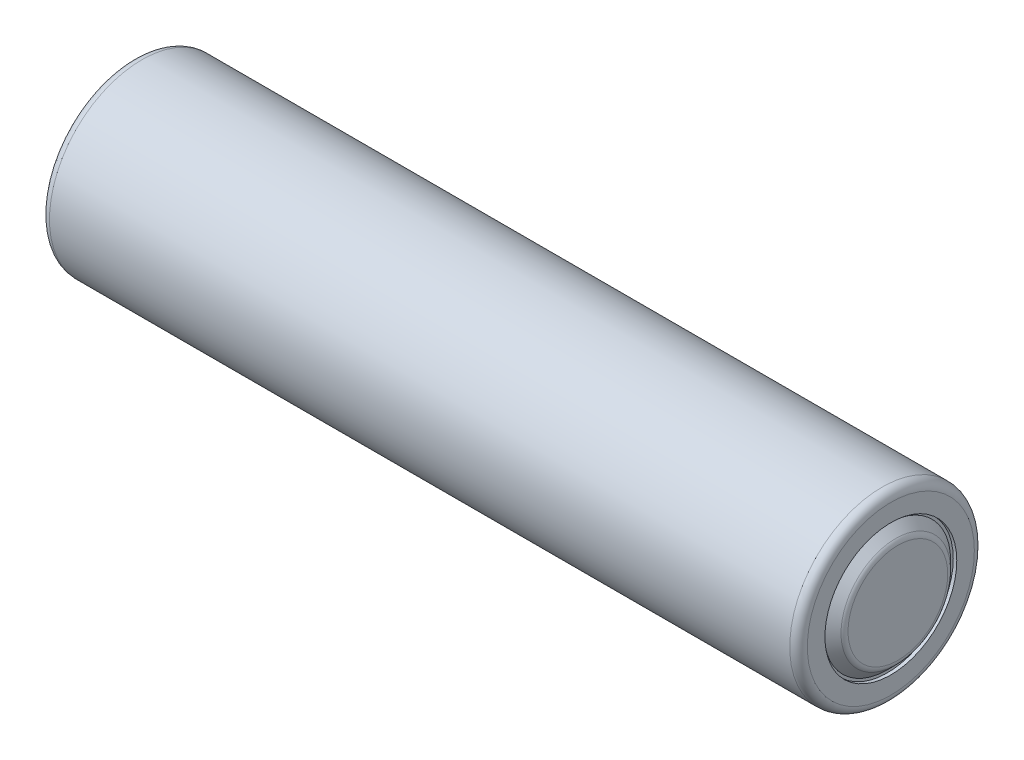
ISO-10303-21;
HEADER;
FILE_DESCRIPTION(('STEP AP214'),'2;1');
FILE_NAME('part.step','',(''),(''),'','','');
FILE_SCHEMA(('AUTOMOTIVE_DESIGN { 1 0 10303 214 1 1 1 1 }'));
ENDSEC;
DATA;
#1=APPLICATION_CONTEXT('core data for automotive mechanical design processes');
#2=APPLICATION_PROTOCOL_DEFINITION('international standard','automotive_design',2000,#1);
#3=PRODUCT_CONTEXT('',#1,'mechanical');
#4=PRODUCT('Part','Part','',(#3));
#5=PRODUCT_RELATED_PRODUCT_CATEGORY('part','',(#4));
#6=PRODUCT_DEFINITION_FORMATION('','',#4);
#7=PRODUCT_DEFINITION_CONTEXT('part definition',#1,'design');
#8=PRODUCT_DEFINITION('design','',#6,#7);
#9=PRODUCT_DEFINITION_SHAPE('','',#8);
#10=(LENGTH_UNIT() NAMED_UNIT(*) SI_UNIT(.MILLI.,.METRE.));
#11=(NAMED_UNIT(*) PLANE_ANGLE_UNIT() SI_UNIT($,.RADIAN.));
#12=(NAMED_UNIT(*) SI_UNIT($,.STERADIAN.) SOLID_ANGLE_UNIT());
#13=UNCERTAINTY_MEASURE_WITH_UNIT(LENGTH_MEASURE(1.E-05),#10,'distance_accuracy_value','');
#14=(GEOMETRIC_REPRESENTATION_CONTEXT(3) GLOBAL_UNCERTAINTY_ASSIGNED_CONTEXT((#13)) GLOBAL_UNIT_ASSIGNED_CONTEXT((#10,
#11,#12)) REPRESENTATION_CONTEXT('',''));
#15=CARTESIAN_POINT('',(0.,0.,0.));
#16=DIRECTION('',(0.,0.,1.));
#17=DIRECTION('',(1.,0.,0.));
#18=AXIS2_PLACEMENT_3D('',#15,#16,#17);
#19=CARTESIAN_POINT('',(0.,0.,0.));
#20=DIRECTION('',(-1.,0.,0.));
#21=DIRECTION('',(0.,0.,1.));
#22=AXIS2_PLACEMENT_3D('',#19,#20,#21);
#23=PLANE('',#22);
#24=CARTESIAN_POINT('',(0.,0.,0.));
#25=DIRECTION('',(1.,0.,0.));
#26=DIRECTION('',(0.,0.,-1.));
#27=AXIS2_PLACEMENT_3D('',#24,#25,#26);
#28=CIRCLE('',#27,0.883974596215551);
#29=CARTESIAN_POINT('',(0.,0.,-0.883974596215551));
#30=VERTEX_POINT('',#29);
#31=EDGE_CURVE('E10',#30,#30,#28,.T.);
#32=ORIENTED_EDGE('',*,*,#31,.F.);
#33=EDGE_LOOP('',(#32));
#34=FACE_BOUND('',#33,.T.);
#35=ADVANCED_FACE('F31',(#34),#23,.T.);
#36=CARTESIAN_POINT('',(0.5,0.,0.));
#37=DIRECTION('',(1.,0.,0.));
#38=DIRECTION('',(0.,0.,-1.));
#39=AXIS2_PLACEMENT_3D('',#36,#37,#38);
#40=TOROIDAL_SURFACE('',#39,0.883974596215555,0.499999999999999);
#41=ORIENTED_EDGE('',*,*,#31,.T.);
#42=EDGE_LOOP('',(#41));
#43=FACE_BOUND('',#42,.T.);
#44=CARTESIAN_POINT('',(0.25,0.,0.));
#45=DIRECTION('',(1.,0.,0.));
#46=DIRECTION('',(0.,0.,-1.));
#47=AXIS2_PLACEMENT_3D('',#44,#45,#46);
#48=CIRCLE('',#47,1.31698729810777);
#49=CARTESIAN_POINT('',(0.25,0.,-1.31698729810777));
#50=VERTEX_POINT('',#49);
#51=EDGE_CURVE('E37',#50,#50,#48,.T.);
#52=ORIENTED_EDGE('',*,*,#51,.F.);
#53=EDGE_LOOP('',(#52));
#54=FACE_BOUND('',#53,.T.);
#55=ADVANCED_FACE('F109',(#43,#54),#40,.T.);
#56=CARTESIAN_POINT('',(0.750000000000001,0.,0.));
#57=DIRECTION('',(1.,0.,0.));
#58=DIRECTION('',(0.,0.,-1.));
#59=AXIS2_PLACEMENT_3D('',#56,#57,#58);
#60=CONICAL_SURFACE('',#59,1.60566243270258,0.523598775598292);
#61=ORIENTED_EDGE('',*,*,#51,.T.);
#62=EDGE_LOOP('',(#61));
#63=FACE_BOUND('',#62,.T.);
#64=CARTESIAN_POINT('',(0.750000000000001,0.,0.));
#65=DIRECTION('',(1.,0.,0.));
#66=DIRECTION('',(0.,0.,-1.));
#67=AXIS2_PLACEMENT_3D('',#64,#65,#66);
#68=CIRCLE('',#67,1.60566243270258);
#69=CARTESIAN_POINT('',(0.750000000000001,0.,-1.60566243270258));
#70=VERTEX_POINT('',#69);
#71=EDGE_CURVE('E41',#70,#70,#68,.T.);
#72=ORIENTED_EDGE('',*,*,#71,.F.);
#73=EDGE_LOOP('',(#72));
#74=FACE_BOUND('',#73,.T.);
#75=ADVANCED_FACE('F114',(#63,#74),#60,.T.);
#76=CARTESIAN_POINT('',(0.5,0.,0.));
#77=DIRECTION('',(1.,0.,0.));
#78=DIRECTION('',(0.,0.,-1.));
#79=AXIS2_PLACEMENT_3D('',#76,#77,#78);
#80=TOROIDAL_SURFACE('',#79,2.0386751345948,0.5);
#81=ORIENTED_EDGE('',*,*,#71,.T.);
#82=EDGE_LOOP('',(#81));
#83=FACE_BOUND('',#82,.T.);
#84=CARTESIAN_POINT('',(1.,0.,0.));
#85=DIRECTION('',(1.,0.,0.));
#86=DIRECTION('',(0.,0.,-1.));
#87=AXIS2_PLACEMENT_3D('',#84,#85,#86);
#88=CIRCLE('',#87,2.0386751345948);
#89=CARTESIAN_POINT('',(1.,0.,-2.0386751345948));
#90=VERTEX_POINT('',#89);
#91=EDGE_CURVE('E45',#90,#90,#88,.T.);
#92=ORIENTED_EDGE('',*,*,#91,.F.);
#93=EDGE_LOOP('',(#92));
#94=FACE_BOUND('',#93,.T.);
#95=ADVANCED_FACE('F118',(#83,#94),#80,.F.);
#96=CARTESIAN_POINT('',(1.,2.0386751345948,0.));
#97=DIRECTION('',(-1.,0.,0.));
#98=DIRECTION('',(0.,0.,1.));
#99=AXIS2_PLACEMENT_3D('',#96,#97,#98);
#100=PLANE('',#99);
#101=ORIENTED_EDGE('',*,*,#91,.T.);
#102=EDGE_LOOP('',(#101));
#103=FACE_BOUND('',#102,.T.);
#104=CARTESIAN_POINT('',(1.,0.,0.));
#105=DIRECTION('',(1.,0.,0.));
#106=DIRECTION('',(0.,0.,-1.));
#107=AXIS2_PLACEMENT_3D('',#104,#105,#106);
#108=CIRCLE('',#107,2.71132486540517);
#109=CARTESIAN_POINT('',(1.,0.,-2.71132486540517));
#110=VERTEX_POINT('',#109);
#111=EDGE_CURVE('E50',#110,#110,#108,.T.);
#112=ORIENTED_EDGE('',*,*,#111,.F.);
#113=EDGE_LOOP('',(#112));
#114=FACE_BOUND('',#113,.T.);
#115=ADVANCED_FACE('F124',(#103,#114),#100,.T.);
#116=CARTESIAN_POINT('',(1.5,0.,0.));
#117=DIRECTION('',(1.,0.,0.));
#118=DIRECTION('',(0.,0.,-1.));
#119=AXIS2_PLACEMENT_3D('',#116,#117,#118);
#120=TOROIDAL_SURFACE('',#119,2.71132486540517,0.5);
#121=ORIENTED_EDGE('',*,*,#111,.T.);
#122=EDGE_LOOP('',(#121));
#123=FACE_BOUND('',#122,.T.);
#124=CARTESIAN_POINT('',(1.25,0.,0.));
#125=DIRECTION('',(1.,0.,0.));
#126=DIRECTION('',(0.,0.,-1.));
#127=AXIS2_PLACEMENT_3D('',#124,#125,#126);
#128=CIRCLE('',#127,3.14433756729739);
#129=CARTESIAN_POINT('',(1.25,0.,-3.14433756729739));
#130=VERTEX_POINT('',#129);
#131=EDGE_CURVE('E53',#130,#130,#128,.T.);
#132=ORIENTED_EDGE('',*,*,#131,.F.);
#133=EDGE_LOOP('',(#132));
#134=FACE_BOUND('',#133,.T.);
#135=ADVANCED_FACE('F128',(#123,#134),#120,.T.);
#136=CARTESIAN_POINT('',(1.5,0.,0.));
#137=DIRECTION('',(1.,0.,0.));
#138=DIRECTION('',(0.,0.,-1.));
#139=AXIS2_PLACEMENT_3D('',#136,#137,#138);
#140=CONICAL_SURFACE('',#139,3.28867513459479,0.523598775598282);
#141=ORIENTED_EDGE('',*,*,#131,.T.);
#142=EDGE_LOOP('',(#141));
#143=FACE_BOUND('',#142,.T.);
#144=CARTESIAN_POINT('',(1.5,0.,0.));
#145=DIRECTION('',(1.,0.,0.));
#146=DIRECTION('',(0.,0.,-1.));
#147=AXIS2_PLACEMENT_3D('',#144,#145,#146);
#148=CIRCLE('',#147,3.28867513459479);
#149=CARTESIAN_POINT('',(1.5,0.,-3.28867513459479));
#150=VERTEX_POINT('',#149);
#151=EDGE_CURVE('E56',#150,#150,#148,.T.);
#152=ORIENTED_EDGE('',*,*,#151,.F.);
#153=EDGE_LOOP('',(#152));
#154=FACE_BOUND('',#153,.T.);
#155=ADVANCED_FACE('F132',(#143,#154),#140,.T.);
#156=CARTESIAN_POINT('',(1.5,3.28867513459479,0.));
#157=DIRECTION('',(-1.,0.,0.));
#158=DIRECTION('',(0.,0.,1.));
#159=AXIS2_PLACEMENT_3D('',#156,#157,#158);
#160=PLANE('',#159);
#161=ORIENTED_EDGE('',*,*,#151,.T.);
#162=EDGE_LOOP('',(#161));
#163=FACE_BOUND('',#162,.T.);
#164=CARTESIAN_POINT('',(1.5,0.,0.));
#165=DIRECTION('',(1.,0.,0.));
#166=DIRECTION('',(0.,0.,-1.));
#167=AXIS2_PLACEMENT_3D('',#164,#165,#166);
#168=CIRCLE('',#167,3.99999999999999);
#169=CARTESIAN_POINT('',(1.5,0.,-3.99999999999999));
#170=VERTEX_POINT('',#169);
#171=EDGE_CURVE('E59',#170,#170,#168,.T.);
#172=ORIENTED_EDGE('',*,*,#171,.F.);
#173=EDGE_LOOP('',(#172));
#174=FACE_BOUND('',#173,.T.);
#175=ADVANCED_FACE('F136',(#163,#174),#160,.T.);
#176=CARTESIAN_POINT('',(102.472385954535,0.,0.));
#177=DIRECTION('',(1.,0.,0.));
#178=DIRECTION('',(0.,0.,-1.));
#179=AXIS2_PLACEMENT_3D('',#176,#177,#178);
#180=CYLINDRICAL_SURFACE('',#179,3.99999999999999);
#181=ORIENTED_EDGE('',*,*,#171,.T.);
#182=EDGE_LOOP('',(#181));
#183=FACE_BOUND('',#182,.T.);
#184=CARTESIAN_POINT('',(1.,0.,0.));
#185=DIRECTION('',(1.,0.,0.));
#186=DIRECTION('',(0.,0.,-1.));
#187=AXIS2_PLACEMENT_3D('',#184,#185,#186);
#188=CIRCLE('',#187,3.99999999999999);
#189=CARTESIAN_POINT('',(1.,0.,-3.99999999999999));
#190=VERTEX_POINT('',#189);
#191=EDGE_CURVE('E62',#190,#190,#188,.T.);
#192=ORIENTED_EDGE('',*,*,#191,.F.);
#193=EDGE_LOOP('',(#192));
#194=FACE_BOUND('',#193,.T.);
#195=ADVANCED_FACE('F140',(#183,#194),#180,.F.);
#196=CARTESIAN_POINT('',(1.,3.99999999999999,0.));
#197=DIRECTION('',(-1.,0.,0.));
#198=DIRECTION('',(0.,0.,1.));
#199=AXIS2_PLACEMENT_3D('',#196,#197,#198);
#200=PLANE('',#199);
#201=ORIENTED_EDGE('',*,*,#191,.T.);
#202=EDGE_LOOP('',(#201));
#203=FACE_BOUND('',#202,.T.);
#204=CARTESIAN_POINT('',(1.,0.,0.));
#205=DIRECTION('',(1.,0.,0.));
#206=DIRECTION('',(0.,0.,-1.));
#207=AXIS2_PLACEMENT_3D('',#204,#205,#206);
#208=CIRCLE('',#207,4.74999999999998);
#209=CARTESIAN_POINT('',(1.,0.,-4.74999999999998));
#210=VERTEX_POINT('',#209);
#211=EDGE_CURVE('E65',#210,#210,#208,.T.);
#212=ORIENTED_EDGE('',*,*,#211,.F.);
#213=EDGE_LOOP('',(#212));
#214=FACE_BOUND('',#213,.T.);
#215=ADVANCED_FACE('F144',(#203,#214),#200,.T.);
#216=CARTESIAN_POINT('',(1.5,0.,0.));
#217=DIRECTION('',(1.,0.,0.));
#218=DIRECTION('',(0.,0.,-1.));
#219=AXIS2_PLACEMENT_3D('',#216,#217,#218);
#220=TOROIDAL_SURFACE('',#219,4.74999999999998,0.5);
#221=ORIENTED_EDGE('',*,*,#211,.T.);
#222=EDGE_LOOP('',(#221));
#223=FACE_BOUND('',#222,.T.);
#224=CARTESIAN_POINT('',(1.5,0.,0.));
#225=DIRECTION('',(1.,0.,0.));
#226=DIRECTION('',(0.,0.,-1.));
#227=AXIS2_PLACEMENT_3D('',#224,#225,#226);
#228=CIRCLE('',#227,5.24999999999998);
#229=CARTESIAN_POINT('',(1.5,0.,-5.24999999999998));
#230=VERTEX_POINT('',#229);
#231=EDGE_CURVE('E68',#230,#230,#228,.T.);
#232=ORIENTED_EDGE('',*,*,#231,.F.);
#233=EDGE_LOOP('',(#232));
#234=FACE_BOUND('',#233,.T.);
#235=ADVANCED_FACE('F148',(#223,#234),#220,.T.);
#236=CARTESIAN_POINT('',(102.472385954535,0.,0.));
#237=DIRECTION('',(1.,0.,0.));
#238=DIRECTION('',(0.,0.,-1.));
#239=AXIS2_PLACEMENT_3D('',#236,#237,#238);
#240=CYLINDRICAL_SURFACE('',#239,5.24999999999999);
#241=ORIENTED_EDGE('',*,*,#231,.T.);
#242=EDGE_LOOP('',(#241));
#243=FACE_BOUND('',#242,.T.);
#244=CARTESIAN_POINT('',(43.6,0.,0.));
#245=DIRECTION('',(1.,0.,0.));
#246=DIRECTION('',(0.,0.,-1.));
#247=AXIS2_PLACEMENT_3D('',#244,#245,#246);
#248=CIRCLE('',#247,5.24999999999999);
#249=CARTESIAN_POINT('',(43.6,0.,-5.24999999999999));
#250=VERTEX_POINT('',#249);
#251=EDGE_CURVE('E71',#250,#250,#248,.T.);
#252=ORIENTED_EDGE('',*,*,#251,.F.);
#253=EDGE_LOOP('',(#252));
#254=FACE_BOUND('',#253,.T.);
#255=ADVANCED_FACE('F152',(#243,#254),#240,.T.);
#256=CARTESIAN_POINT('',(43.6,0.,0.));
#257=DIRECTION('',(1.,0.,0.));
#258=DIRECTION('',(0.,0.,-1.));
#259=AXIS2_PLACEMENT_3D('',#256,#257,#258);
#260=TOROIDAL_SURFACE('',#259,4.74999999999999,0.5);
#261=ORIENTED_EDGE('',*,*,#251,.T.);
#262=EDGE_LOOP('',(#261));
#263=FACE_BOUND('',#262,.T.);
#264=CARTESIAN_POINT('',(44.1,0.,0.));
#265=DIRECTION('',(1.,0.,0.));
#266=DIRECTION('',(0.,0.,-1.));
#267=AXIS2_PLACEMENT_3D('',#264,#265,#266);
#268=CIRCLE('',#267,4.74999999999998);
#269=CARTESIAN_POINT('',(44.1,0.,-4.74999999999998));
#270=VERTEX_POINT('',#269);
#271=EDGE_CURVE('E74',#270,#270,#268,.T.);
#272=ORIENTED_EDGE('',*,*,#271,.F.);
#273=EDGE_LOOP('',(#272));
#274=FACE_BOUND('',#273,.T.);
#275=ADVANCED_FACE('F156',(#263,#274),#260,.T.);
#276=CARTESIAN_POINT('',(44.1,4.74999999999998,0.));
#277=DIRECTION('',(1.,0.,0.));
#278=DIRECTION('',(0.,0.,-1.));
#279=AXIS2_PLACEMENT_3D('',#276,#277,#278);
#280=PLANE('',#279);
#281=ORIENTED_EDGE('',*,*,#271,.T.);
#282=EDGE_LOOP('',(#281));
#283=FACE_BOUND('',#282,.T.);
#284=CARTESIAN_POINT('',(44.1,0.,0.));
#285=DIRECTION('',(1.,0.,0.));
#286=DIRECTION('',(0.,0.,-1.));
#287=AXIS2_PLACEMENT_3D('',#284,#285,#286);
#288=CIRCLE('',#287,3.74999999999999);
#289=CARTESIAN_POINT('',(44.1,0.,-3.74999999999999));
#290=VERTEX_POINT('',#289);
#291=EDGE_CURVE('E77',#290,#290,#288,.T.);
#292=ORIENTED_EDGE('',*,*,#291,.F.);
#293=EDGE_LOOP('',(#292));
#294=FACE_BOUND('',#293,.T.);
#295=ADVANCED_FACE('F160',(#283,#294),#280,.T.);
#296=CARTESIAN_POINT('',(102.472385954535,0.,0.));
#297=DIRECTION('',(1.,0.,0.));
#298=DIRECTION('',(0.,0.,-1.));
#299=AXIS2_PLACEMENT_3D('',#296,#297,#298);
#300=CYLINDRICAL_SURFACE('',#299,3.74999999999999);
#301=ORIENTED_EDGE('',*,*,#291,.T.);
#302=EDGE_LOOP('',(#301));
#303=FACE_BOUND('',#302,.T.);
#304=CARTESIAN_POINT('',(43.9,0.,0.));
#305=DIRECTION('',(1.,0.,0.));
#306=DIRECTION('',(0.,0.,-1.));
#307=AXIS2_PLACEMENT_3D('',#304,#305,#306);
#308=CIRCLE('',#307,3.74999999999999);
#309=CARTESIAN_POINT('',(43.9,0.,-3.74999999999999));
#310=VERTEX_POINT('',#309);
#311=EDGE_CURVE('E80',#310,#310,#308,.T.);
#312=ORIENTED_EDGE('',*,*,#311,.F.);
#313=EDGE_LOOP('',(#312));
#314=FACE_BOUND('',#313,.T.);
#315=ADVANCED_FACE('F164',(#303,#314),#300,.F.);
#316=CARTESIAN_POINT('',(43.9,3.74999999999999,0.));
#317=DIRECTION('',(1.,0.,0.));
#318=DIRECTION('',(0.,0.,-1.));
#319=AXIS2_PLACEMENT_3D('',#316,#317,#318);
#320=PLANE('',#319);
#321=ORIENTED_EDGE('',*,*,#311,.T.);
#322=EDGE_LOOP('',(#321));
#323=FACE_BOUND('',#322,.T.);
#324=CARTESIAN_POINT('',(43.9,0.,0.));
#325=DIRECTION('',(1.,0.,0.));
#326=DIRECTION('',(0.,0.,-1.));
#327=AXIS2_PLACEMENT_3D('',#324,#325,#326);
#328=CIRCLE('',#327,3.59999999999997);
#329=CARTESIAN_POINT('',(43.9,0.,-3.59999999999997));
#330=VERTEX_POINT('',#329);
#331=EDGE_CURVE('E83',#330,#330,#328,.T.);
#332=ORIENTED_EDGE('',*,*,#331,.F.);
#333=EDGE_LOOP('',(#332));
#334=FACE_BOUND('',#333,.T.);
#335=ADVANCED_FACE('F105',(#323,#334),#320,.T.);
#336=CARTESIAN_POINT('',(44.3828427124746,0.,0.));
#337=DIRECTION('',(-1.,0.,0.));
#338=DIRECTION('',(0.,0.,1.));
#339=AXIS2_PLACEMENT_3D('',#336,#337,#338);
#340=CONICAL_SURFACE('',#339,3.11715728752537,0.785398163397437);
#341=ORIENTED_EDGE('',*,*,#331,.T.);
#342=EDGE_LOOP('',(#341));
#343=FACE_BOUND('',#342,.T.);
#344=CARTESIAN_POINT('',(44.3828427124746,0.,0.));
#345=DIRECTION('',(1.,0.,0.));
#346=DIRECTION('',(0.,0.,-1.));
#347=AXIS2_PLACEMENT_3D('',#344,#345,#346);
#348=CIRCLE('',#347,3.11715728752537);
#349=CARTESIAN_POINT('',(44.3828427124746,0.,-3.11715728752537));
#350=VERTEX_POINT('',#349);
#351=EDGE_CURVE('E86',#350,#350,#348,.T.);
#352=ORIENTED_EDGE('',*,*,#351,.F.);
#353=EDGE_LOOP('',(#352));
#354=FACE_BOUND('',#353,.T.);
#355=ADVANCED_FACE('F97',(#343,#354),#340,.T.);
#356=CARTESIAN_POINT('',(44.1,0.,0.));
#357=DIRECTION('',(1.,0.,0.));
#358=DIRECTION('',(0.,0.,-1.));
#359=AXIS2_PLACEMENT_3D('',#356,#357,#358);
#360=TOROIDAL_SURFACE('',#359,2.83431457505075,0.400000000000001);
#361=ORIENTED_EDGE('',*,*,#351,.T.);
#362=EDGE_LOOP('',(#361));
#363=FACE_BOUND('',#362,.T.);
#364=CARTESIAN_POINT('',(44.5,0.,0.));
#365=DIRECTION('',(1.,0.,0.));
#366=DIRECTION('',(0.,0.,-1.));
#367=AXIS2_PLACEMENT_3D('',#364,#365,#366);
#368=CIRCLE('',#367,2.83431457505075);
#369=CARTESIAN_POINT('',(44.5,0.,-2.83431457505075));
#370=VERTEX_POINT('',#369);
#371=EDGE_CURVE('E89',#370,#370,#368,.T.);
#372=ORIENTED_EDGE('',*,*,#371,.F.);
#373=EDGE_LOOP('',(#372));
#374=FACE_BOUND('',#373,.T.);
#375=ADVANCED_FACE('F95',(#363,#374),#360,.T.);
#376=CARTESIAN_POINT('',(44.5,2.83431457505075,0.));
#377=DIRECTION('',(1.,0.,0.));
#378=DIRECTION('',(0.,0.,-1.));
#379=AXIS2_PLACEMENT_3D('',#376,#377,#378);
#380=PLANE('',#379);
#381=ORIENTED_EDGE('',*,*,#371,.T.);
#382=EDGE_LOOP('',(#381));
#383=FACE_BOUND('',#382,.T.);
#384=ADVANCED_FACE('F93',(#383),#380,.T.);
#385=CLOSED_SHELL('',(#35,#55,#75,#95,#115,#135,#155,#175,#195,#215,#235,#255,#275,#295,#315,
#335,#355,#375,#384));
#386=MANIFOLD_SOLID_BREP('B2',#385);
#387=ADVANCED_BREP_SHAPE_REPRESENTATION('',(#18,#386),#14);
#388=SHAPE_DEFINITION_REPRESENTATION(#9,#387);
ENDSEC;
END-ISO-10303-21;
